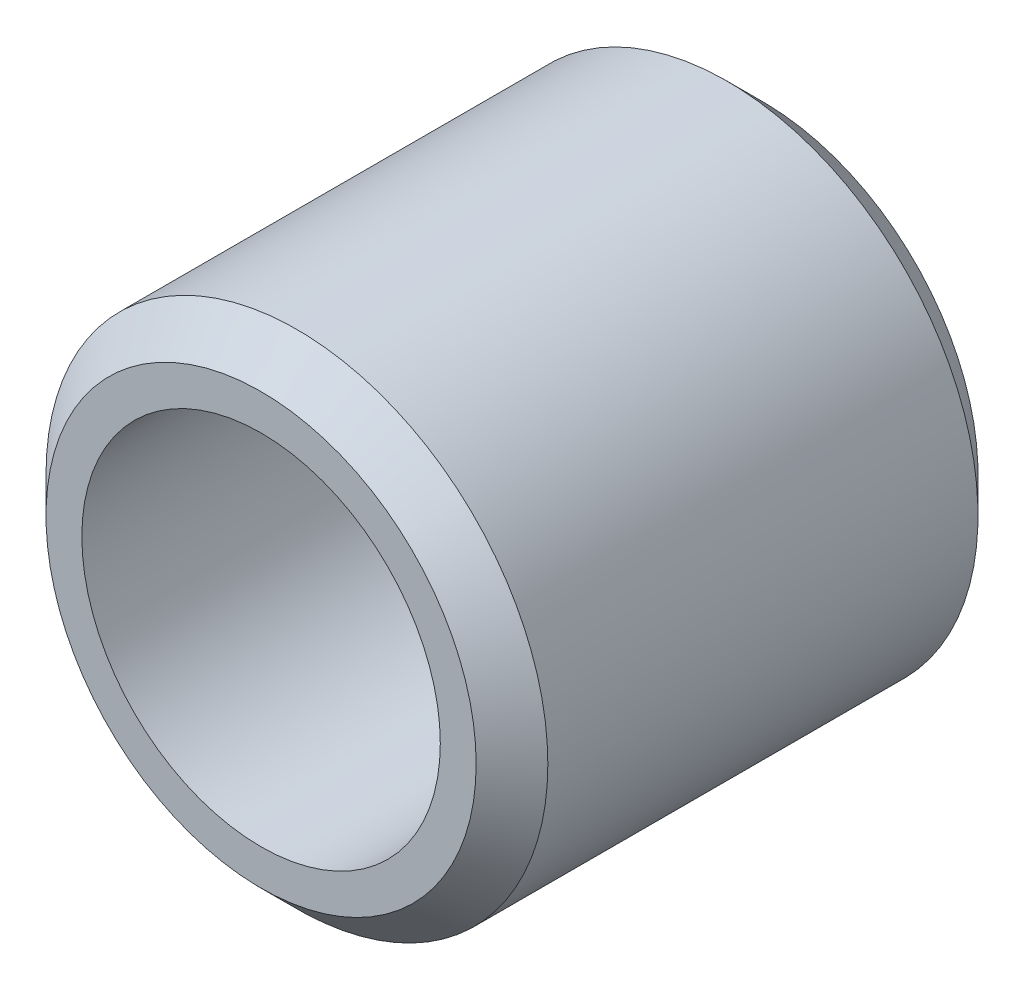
ISO-10303-21;
HEADER;
FILE_DESCRIPTION(('STEP AP214'),'2;1');
FILE_NAME('part.step','',(''),(''),'','','');
FILE_SCHEMA(('AUTOMOTIVE_DESIGN { 1 0 10303 214 1 1 1 1 }'));
ENDSEC;
DATA;
#1=APPLICATION_CONTEXT('core data for automotive mechanical design processes');
#2=APPLICATION_PROTOCOL_DEFINITION('international standard','automotive_design',2000,#1);
#3=PRODUCT_CONTEXT('',#1,'mechanical');
#4=PRODUCT('Part','Part','',(#3));
#5=PRODUCT_RELATED_PRODUCT_CATEGORY('part','',(#4));
#6=PRODUCT_DEFINITION_FORMATION('','',#4);
#7=PRODUCT_DEFINITION_CONTEXT('part definition',#1,'design');
#8=PRODUCT_DEFINITION('design','',#6,#7);
#9=PRODUCT_DEFINITION_SHAPE('','',#8);
#10=(LENGTH_UNIT() NAMED_UNIT(*) SI_UNIT(.MILLI.,.METRE.));
#11=(NAMED_UNIT(*) PLANE_ANGLE_UNIT() SI_UNIT($,.RADIAN.));
#12=(NAMED_UNIT(*) SI_UNIT($,.STERADIAN.) SOLID_ANGLE_UNIT());
#13=UNCERTAINTY_MEASURE_WITH_UNIT(LENGTH_MEASURE(1.E-05),#10,'distance_accuracy_value','');
#14=(GEOMETRIC_REPRESENTATION_CONTEXT(3) GLOBAL_UNCERTAINTY_ASSIGNED_CONTEXT((#13)) GLOBAL_UNIT_ASSIGNED_CONTEXT((#10,
#11,#12)) REPRESENTATION_CONTEXT('',''));
#15=CARTESIAN_POINT('',(0.,0.,0.));
#16=DIRECTION('',(0.,0.,1.));
#17=DIRECTION('',(1.,0.,0.));
#18=AXIS2_PLACEMENT_3D('',#15,#16,#17);
#19=CARTESIAN_POINT('',(0.,0.,0.));
#20=DIRECTION('',(0.,0.,-1.));
#21=DIRECTION('',(-1.,0.,0.));
#22=AXIS2_PLACEMENT_3D('',#19,#20,#21);
#23=CYLINDRICAL_SURFACE('',#22,5.);
#24=CARTESIAN_POINT('',(0.,0.,0.));
#25=DIRECTION('',(0.,0.,-1.));
#26=DIRECTION('',(-1.,0.,0.));
#27=AXIS2_PLACEMENT_3D('',#24,#25,#26);
#28=CIRCLE('',#27,5.);
#29=CARTESIAN_POINT('',(-5.,0.,0.));
#30=VERTEX_POINT('',#29);
#31=EDGE_CURVE('E34',#30,#30,#28,.T.);
#32=ORIENTED_EDGE('',*,*,#31,.T.);
#33=EDGE_LOOP('',(#32));
#34=FACE_BOUND('',#33,.T.);
#35=CARTESIAN_POINT('',(0.,0.,14.));
#36=DIRECTION('',(0.,0.,-1.));
#37=DIRECTION('',(-1.,0.,0.));
#38=AXIS2_PLACEMENT_3D('',#35,#36,#37);
#39=CIRCLE('',#38,5.);
#40=CARTESIAN_POINT('',(-5.,0.,14.));
#41=VERTEX_POINT('',#40);
#42=EDGE_CURVE('E31',#41,#41,#39,.T.);
#43=ORIENTED_EDGE('',*,*,#42,.F.);
#44=EDGE_LOOP('',(#43));
#45=FACE_BOUND('',#44,.T.);
#46=ADVANCED_FACE('F12',(#34,#45),#23,.F.);
#47=CARTESIAN_POINT('',(-5.,0.,14.));
#48=DIRECTION('',(0.,0.,1.));
#49=DIRECTION('',(1.,0.,0.));
#50=AXIS2_PLACEMENT_3D('',#47,#48,#49);
#51=PLANE('',#50);
#52=CARTESIAN_POINT('',(0.,0.,14.));
#53=DIRECTION('',(0.,0.,1.));
#54=DIRECTION('',(1.,0.,0.));
#55=AXIS2_PLACEMENT_3D('',#52,#53,#54);
#56=CIRCLE('',#55,6.);
#57=CARTESIAN_POINT('',(6.,0.,14.));
#58=VERTEX_POINT('',#57);
#59=EDGE_CURVE('E8',#58,#58,#56,.T.);
#60=ORIENTED_EDGE('',*,*,#59,.T.);
#61=EDGE_LOOP('',(#60));
#62=FACE_BOUND('',#61,.T.);
#63=ORIENTED_EDGE('',*,*,#42,.T.);
#64=EDGE_LOOP('',(#63));
#65=FACE_BOUND('',#64,.T.);
#66=ADVANCED_FACE('F55',(#62,#65),#51,.T.);
#67=CARTESIAN_POINT('',(0.,0.,0.));
#68=DIRECTION('',(0.,0.,-1.));
#69=DIRECTION('',(-1.,0.,0.));
#70=AXIS2_PLACEMENT_3D('',#67,#68,#69);
#71=CYLINDRICAL_SURFACE('',#70,7.);
#72=CARTESIAN_POINT('',(0.,0.,0.999999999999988));
#73=DIRECTION('',(0.,0.,-1.));
#74=DIRECTION('',(-1.,0.,0.));
#75=AXIS2_PLACEMENT_3D('',#72,#73,#74);
#76=CIRCLE('',#75,7.);
#77=CARTESIAN_POINT('',(-7.,0.,0.999999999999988));
#78=VERTEX_POINT('',#77);
#79=EDGE_CURVE('E18',#78,#78,#76,.F.);
#80=ORIENTED_EDGE('',*,*,#79,.T.);
#81=EDGE_LOOP('',(#80));
#82=FACE_BOUND('',#81,.T.);
#83=CARTESIAN_POINT('',(0.,0.,13.));
#84=DIRECTION('',(0.,0.,1.));
#85=DIRECTION('',(1.,0.,0.));
#86=AXIS2_PLACEMENT_3D('',#83,#84,#85);
#87=CIRCLE('',#86,7.);
#88=CARTESIAN_POINT('',(7.,0.,13.));
#89=VERTEX_POINT('',#88);
#90=EDGE_CURVE('E22',#89,#89,#87,.F.);
#91=ORIENTED_EDGE('',*,*,#90,.T.);
#92=EDGE_LOOP('',(#91));
#93=FACE_BOUND('',#92,.T.);
#94=ADVANCED_FACE('F43',(#82,#93),#71,.T.);
#95=CARTESIAN_POINT('',(-5.,0.,0.));
#96=DIRECTION('',(0.,0.,-1.));
#97=DIRECTION('',(-1.,0.,0.));
#98=AXIS2_PLACEMENT_3D('',#95,#96,#97);
#99=PLANE('',#98);
#100=CARTESIAN_POINT('',(0.,0.,0.));
#101=DIRECTION('',(0.,0.,-1.));
#102=DIRECTION('',(-1.,0.,0.));
#103=AXIS2_PLACEMENT_3D('',#100,#101,#102);
#104=CIRCLE('',#103,6.);
#105=CARTESIAN_POINT('',(-6.,0.,0.));
#106=VERTEX_POINT('',#105);
#107=EDGE_CURVE('E26',#106,#106,#104,.T.);
#108=ORIENTED_EDGE('',*,*,#107,.T.);
#109=EDGE_LOOP('',(#108));
#110=FACE_BOUND('',#109,.T.);
#111=ORIENTED_EDGE('',*,*,#31,.F.);
#112=EDGE_LOOP('',(#111));
#113=FACE_BOUND('',#112,.T.);
#114=ADVANCED_FACE('F40',(#110,#113),#99,.T.);
#115=CARTESIAN_POINT('',(0.,0.,0.));
#116=DIRECTION('',(0.,0.,1.));
#117=DIRECTION('',(1.,0.,0.));
#118=AXIS2_PLACEMENT_3D('',#115,#116,#117);
#119=CONICAL_SURFACE('',#118,6.,0.785398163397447);
#120=ORIENTED_EDGE('',*,*,#79,.F.);
#121=EDGE_LOOP('',(#120));
#122=FACE_BOUND('',#121,.T.);
#123=ORIENTED_EDGE('',*,*,#107,.F.);
#124=EDGE_LOOP('',(#123));
#125=FACE_BOUND('',#124,.T.);
#126=ADVANCED_FACE('F42',(#122,#125),#119,.T.);
#127=CARTESIAN_POINT('',(0.,0.,13.));
#128=DIRECTION('',(0.,0.,-1.));
#129=DIRECTION('',(-1.,0.,0.));
#130=AXIS2_PLACEMENT_3D('',#127,#128,#129);
#131=CONICAL_SURFACE('',#130,7.,0.78539816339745);
#132=ORIENTED_EDGE('',*,*,#59,.F.);
#133=EDGE_LOOP('',(#132));
#134=FACE_BOUND('',#133,.T.);
#135=ORIENTED_EDGE('',*,*,#90,.F.);
#136=EDGE_LOOP('',(#135));
#137=FACE_BOUND('',#136,.T.);
#138=ADVANCED_FACE('F52',(#134,#137),#131,.T.);
#139=CLOSED_SHELL('',(#46,#66,#94,#114,#126,#138));
#140=MANIFOLD_SOLID_BREP('B1',#139);
#141=ADVANCED_BREP_SHAPE_REPRESENTATION('',(#18,#140),#14);
#142=SHAPE_DEFINITION_REPRESENTATION(#9,#141);
ENDSEC;
END-ISO-10303-21;
